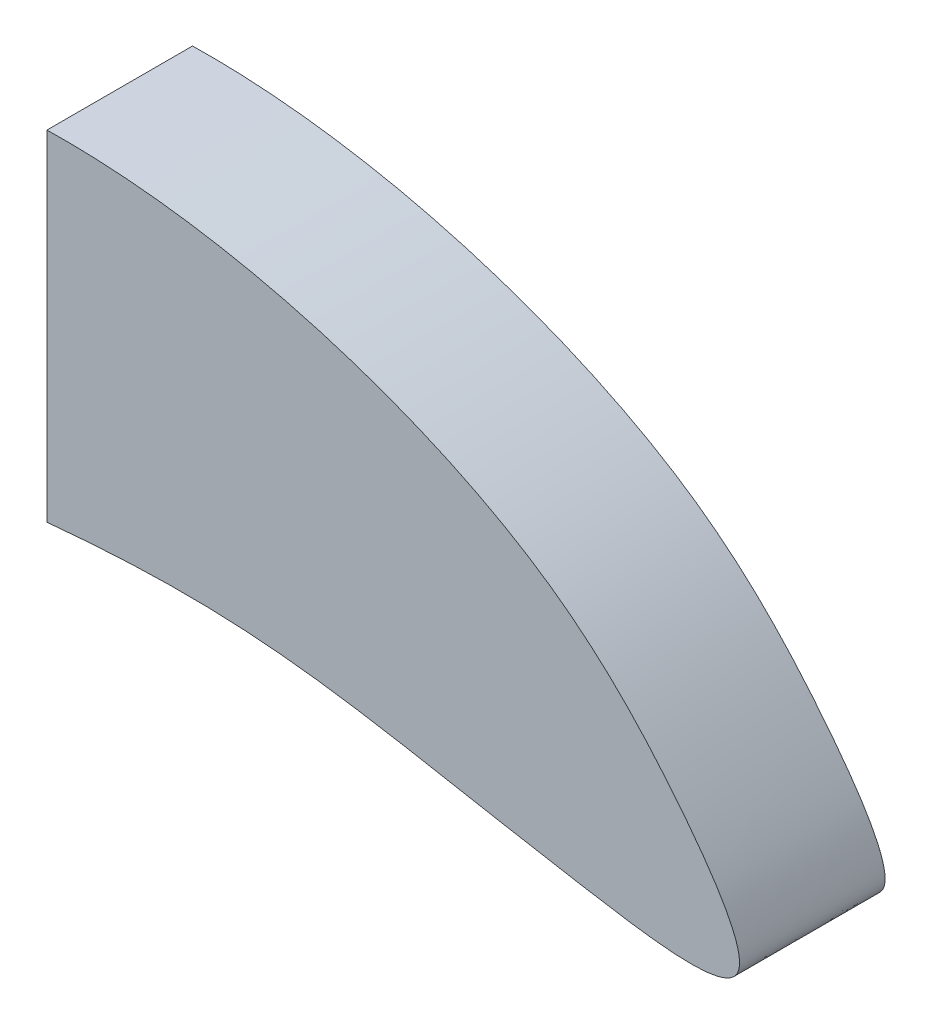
from build123d import *

# Parameters (mm, degrees)
SALIENTE_EXTRUIR1_DEPTH = 6


with BuildPart() as part:
    # Croquis1 → Saliente-Extruir1 (new body)
    with BuildSketch(Plane.XY):
        with BuildLine():
            Line((0, 0), (0, 14))
            add(Edge.make_bspline(
                [(0, 14), (6.341643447, 14.131443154), (17.194165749, 11.39772574), (24.829707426, 4.985364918), (30.492718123, -3.246609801), (13.930102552, -0.801041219), (9.574465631, 0.910116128), (0, 0)],
                knots=[0, 0, 0, 0, 0.310379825, 0.464659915, 0.546691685, 0.637850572, 1, 1, 1, 1], degree=3))
        make_face()
    extrude(amount=SALIENTE_EXTRUIR1_DEPTH)


solid = part.part
